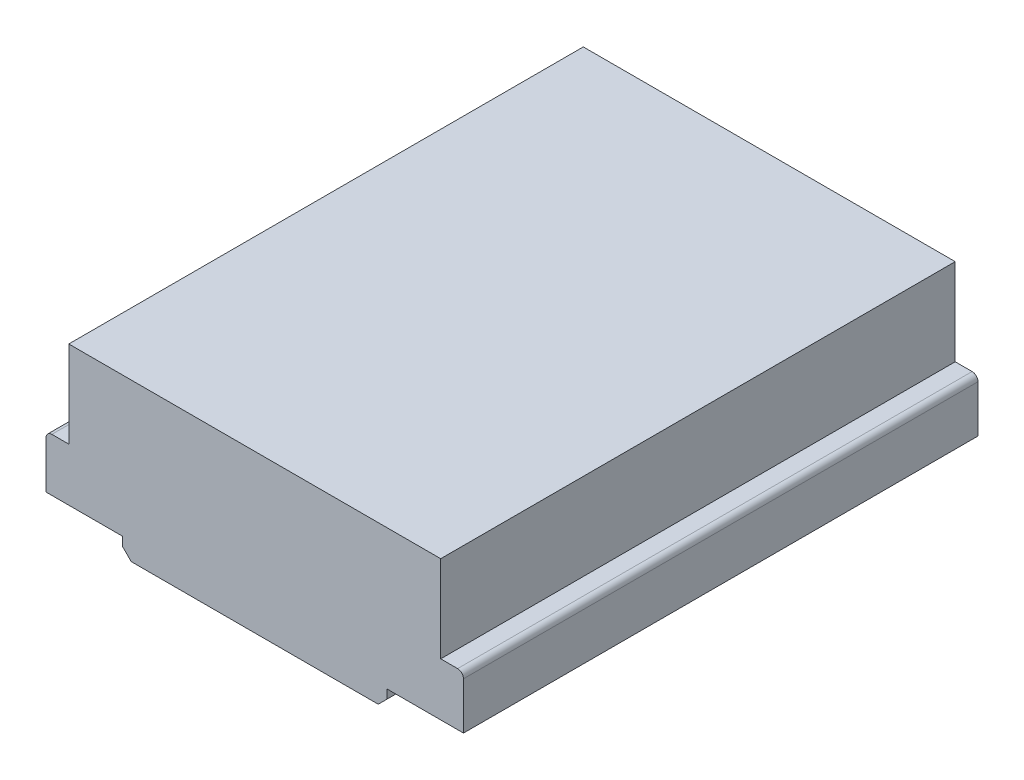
ISO-10303-21;
HEADER;
FILE_DESCRIPTION(('STEP AP214'),'2;1');
FILE_NAME('part.step','',(''),(''),'','','');
FILE_SCHEMA(('AUTOMOTIVE_DESIGN { 1 0 10303 214 1 1 1 1 }'));
ENDSEC;
DATA;
#1=APPLICATION_CONTEXT('core data for automotive mechanical design processes');
#2=APPLICATION_PROTOCOL_DEFINITION('international standard','automotive_design',2000,#1);
#3=PRODUCT_CONTEXT('',#1,'mechanical');
#4=PRODUCT('Part','Part','',(#3));
#5=PRODUCT_RELATED_PRODUCT_CATEGORY('part','',(#4));
#6=PRODUCT_DEFINITION_FORMATION('','',#4);
#7=PRODUCT_DEFINITION_CONTEXT('part definition',#1,'design');
#8=PRODUCT_DEFINITION('design','',#6,#7);
#9=PRODUCT_DEFINITION_SHAPE('','',#8);
#10=(LENGTH_UNIT() NAMED_UNIT(*) SI_UNIT(.MILLI.,.METRE.));
#11=(NAMED_UNIT(*) PLANE_ANGLE_UNIT() SI_UNIT($,.RADIAN.));
#12=(NAMED_UNIT(*) SI_UNIT($,.STERADIAN.) SOLID_ANGLE_UNIT());
#13=UNCERTAINTY_MEASURE_WITH_UNIT(LENGTH_MEASURE(1.E-05),#10,'distance_accuracy_value','');
#14=(GEOMETRIC_REPRESENTATION_CONTEXT(3) GLOBAL_UNCERTAINTY_ASSIGNED_CONTEXT((#13)) GLOBAL_UNIT_ASSIGNED_CONTEXT((#10,
#11,#12)) REPRESENTATION_CONTEXT('',''));
#15=CARTESIAN_POINT('',(0.,0.,0.));
#16=DIRECTION('',(0.,0.,1.));
#17=DIRECTION('',(1.,0.,0.));
#18=AXIS2_PLACEMENT_3D('',#15,#16,#17);
#19=CARTESIAN_POINT('',(2.957133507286E-05,0.983808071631,8.75));
#20=DIRECTION('',(0.,0.,1.));
#21=DIRECTION('',(1.,0.,0.));
#22=AXIS2_PLACEMENT_3D('',#19,#20,#21);
#23=PLANE('',#22);
#24=DIRECTION('',(-0.707106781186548,-0.707106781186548,0.));
#25=VECTOR('',#24,1.);
#26=CARTESIAN_POINT('',(3.884492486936,-1.969580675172,8.75));
#27=LINE('',#26,#25);
#28=CARTESIAN_POINT('',(4.500029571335,-1.354043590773,8.75));
#29=VERTEX_POINT('',#28);
#30=CARTESIAN_POINT('',(4.200029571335,-1.654043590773,8.75));
#31=VERTEX_POINT('',#30);
#32=EDGE_CURVE('E278',#29,#31,#27,.T.);
#33=ORIENTED_EDGE('',*,*,#32,.F.);
#34=DIRECTION('',(0.,1.,0.));
#35=VECTOR('',#34,1.);
#36=CARTESIAN_POINT('',(4.500029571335,-1.654043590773,8.75));
#37=LINE('',#36,#35);
#38=CARTESIAN_POINT('',(4.500029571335,-1.054043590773,8.75));
#39=VERTEX_POINT('',#38);
#40=EDGE_CURVE('E47',#29,#39,#37,.T.);
#41=ORIENTED_EDGE('',*,*,#40,.T.);
#42=DIRECTION('',(1.,0.,0.));
#43=VECTOR('',#42,1.);
#44=CARTESIAN_POINT('',(4.500029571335,-1.054043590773,8.75));
#45=LINE('',#44,#43);
#46=CARTESIAN_POINT('',(7.100029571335,-1.054043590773,8.75));
#47=VERTEX_POINT('',#46);
#48=EDGE_CURVE('E359',#39,#47,#45,.T.);
#49=ORIENTED_EDGE('',*,*,#48,.T.);
#50=DIRECTION('',(0.,1.,0.));
#51=VECTOR('',#50,1.);
#52=CARTESIAN_POINT('',(7.100029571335,-1.054043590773,8.75));
#53=LINE('',#52,#51);
#54=CARTESIAN_POINT('',(7.100029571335,0.545956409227,8.75));
#55=VERTEX_POINT('',#54);
#56=EDGE_CURVE('E360',#47,#55,#53,.T.);
#57=ORIENTED_EDGE('',*,*,#56,.T.);
#58=CARTESIAN_POINT('',(6.900029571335,0.545956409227,8.75));
#59=DIRECTION('',(0.,0.,-1.));
#60=DIRECTION('',(0.707106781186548,0.707106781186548,0.));
#61=AXIS2_PLACEMENT_3D('',#58,#59,#60);
#62=CIRCLE('',#61,0.2);
#63=CARTESIAN_POINT('',(6.900029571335,0.745956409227,8.75));
#64=VERTEX_POINT('',#63);
#65=EDGE_CURVE('E284',#64,#55,#62,.T.);
#66=ORIENTED_EDGE('',*,*,#65,.F.);
#67=DIRECTION('',(-1.,0.,0.));
#68=VECTOR('',#67,1.);
#69=CARTESIAN_POINT('',(7.100029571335,0.745956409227,8.75));
#70=LINE('',#69,#68);
#71=CARTESIAN_POINT('',(6.325029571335,0.745956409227,8.75));
#72=VERTEX_POINT('',#71);
#73=EDGE_CURVE('E372',#64,#72,#70,.T.);
#74=ORIENTED_EDGE('',*,*,#73,.T.);
#75=DIRECTION('',(0.,1.,0.));
#76=VECTOR('',#75,1.);
#77=CARTESIAN_POINT('',(6.325029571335,0.745956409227,8.75));
#78=LINE('',#77,#76);
#79=CARTESIAN_POINT('',(6.325029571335,3.695956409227,8.75));
#80=VERTEX_POINT('',#79);
#81=EDGE_CURVE('E436',#72,#80,#78,.T.);
#82=ORIENTED_EDGE('',*,*,#81,.T.);
#83=DIRECTION('',(-1.,0.,0.));
#84=VECTOR('',#83,1.);
#85=CARTESIAN_POINT('',(6.325029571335,3.695956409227,8.75));
#86=LINE('',#85,#84);
#87=CARTESIAN_POINT('',(-6.324970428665,3.695956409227,8.75));
#88=VERTEX_POINT('',#87);
#89=EDGE_CURVE('E429',#80,#88,#86,.T.);
#90=ORIENTED_EDGE('',*,*,#89,.T.);
#91=DIRECTION('',(0.,-1.,0.));
#92=VECTOR('',#91,1.);
#93=CARTESIAN_POINT('',(-6.324970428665,3.695956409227,8.75));
#94=LINE('',#93,#92);
#95=CARTESIAN_POINT('',(-6.324970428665,0.745956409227,8.75));
#96=VERTEX_POINT('',#95);
#97=EDGE_CURVE('E347',#88,#96,#94,.T.);
#98=ORIENTED_EDGE('',*,*,#97,.T.);
#99=DIRECTION('',(-1.,0.,0.));
#100=VECTOR('',#99,1.);
#101=CARTESIAN_POINT('',(-6.324970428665,0.745956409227,8.75));
#102=LINE('',#101,#100);
#103=CARTESIAN_POINT('',(-6.899970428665,0.745956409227,8.75));
#104=VERTEX_POINT('',#103);
#105=EDGE_CURVE('E11',#96,#104,#102,.T.);
#106=ORIENTED_EDGE('',*,*,#105,.T.);
#107=CARTESIAN_POINT('',(-6.899970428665,0.545956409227,8.75));
#108=DIRECTION('',(0.,0.,-1.));
#109=DIRECTION('',(-0.707106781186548,0.707106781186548,0.));
#110=AXIS2_PLACEMENT_3D('',#107,#108,#109);
#111=CIRCLE('',#110,0.2);
#112=CARTESIAN_POINT('',(-7.099970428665,0.545956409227,8.75));
#113=VERTEX_POINT('',#112);
#114=EDGE_CURVE('E365',#113,#104,#111,.T.);
#115=ORIENTED_EDGE('',*,*,#114,.F.);
#116=DIRECTION('',(0.,-1.,0.));
#117=VECTOR('',#116,1.);
#118=CARTESIAN_POINT('',(-7.099970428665,0.745956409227,8.75));
#119=LINE('',#118,#117);
#120=CARTESIAN_POINT('',(-7.099970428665,-1.054043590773,8.75));
#121=VERTEX_POINT('',#120);
#122=EDGE_CURVE('E348',#113,#121,#119,.T.);
#123=ORIENTED_EDGE('',*,*,#122,.T.);
#124=DIRECTION('',(1.,0.,0.));
#125=VECTOR('',#124,1.);
#126=CARTESIAN_POINT('',(-7.099970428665,-1.054043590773,8.75));
#127=LINE('',#126,#125);
#128=CARTESIAN_POINT('',(-4.499970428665,-1.054043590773,8.75));
#129=VERTEX_POINT('',#128);
#130=EDGE_CURVE('E444',#121,#129,#127,.T.);
#131=ORIENTED_EDGE('',*,*,#130,.T.);
#132=DIRECTION('',(0.,-1.,0.));
#133=VECTOR('',#132,1.);
#134=CARTESIAN_POINT('',(-4.499970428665,-1.054043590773,8.75));
#135=LINE('',#134,#133);
#136=CARTESIAN_POINT('',(-4.499970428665,-1.354043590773,8.75));
#137=VERTEX_POINT('',#136);
#138=EDGE_CURVE('E26',#129,#137,#135,.T.);
#139=ORIENTED_EDGE('',*,*,#138,.T.);
#140=DIRECTION('',(-0.707106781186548,0.707106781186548,0.));
#141=VECTOR('',#140,1.);
#142=CARTESIAN_POINT('',(-3.884433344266,-1.969580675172,8.75));
#143=LINE('',#142,#141);
#144=CARTESIAN_POINT('',(-4.199970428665,-1.654043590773,8.75));
#145=VERTEX_POINT('',#144);
#146=EDGE_CURVE('E325',#145,#137,#143,.T.);
#147=ORIENTED_EDGE('',*,*,#146,.F.);
#148=DIRECTION('',(1.,0.,0.));
#149=VECTOR('',#148,1.);
#150=CARTESIAN_POINT('',(-4.499970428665,-1.654043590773,8.75));
#151=LINE('',#150,#149);
#152=EDGE_CURVE('E318',#145,#31,#151,.T.);
#153=ORIENTED_EDGE('',*,*,#152,.T.);
#154=EDGE_LOOP('',(#33,#41,#49,#57,#66,#74,#82,#90,#98,#106,#115,#123,#131,#139,#147,#153));
#155=FACE_BOUND('',#154,.T.);
#156=ADVANCED_FACE('F17',(#155),#23,.T.);
#157=CARTESIAN_POINT('',(-6.324970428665,0.745956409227,0.));
#158=DIRECTION('',(0.,1.,0.));
#159=DIRECTION('',(1.,0.,0.));
#160=AXIS2_PLACEMENT_3D('',#157,#158,#159);
#161=PLANE('',#160);
#162=DIRECTION('',(0.,0.,-1.));
#163=VECTOR('',#162,1.);
#164=CARTESIAN_POINT('',(-6.899970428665,0.745956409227,0.));
#165=LINE('',#164,#163);
#166=CARTESIAN_POINT('',(-6.899970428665,0.745956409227,-8.75));
#167=VERTEX_POINT('',#166);
#168=EDGE_CURVE('E361',#104,#167,#165,.T.);
#169=ORIENTED_EDGE('',*,*,#168,.F.);
#170=ORIENTED_EDGE('',*,*,#105,.F.);
#171=DIRECTION('',(0.,0.,-1.));
#172=VECTOR('',#171,1.);
#173=CARTESIAN_POINT('',(-6.324970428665,0.745956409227,0.));
#174=LINE('',#173,#172);
#175=CARTESIAN_POINT('',(-6.324970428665,0.745956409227,-8.75));
#176=VERTEX_POINT('',#175);
#177=EDGE_CURVE('E344',#96,#176,#174,.T.);
#178=ORIENTED_EDGE('',*,*,#177,.T.);
#179=DIRECTION('',(1.,0.,0.));
#180=VECTOR('',#179,1.);
#181=CARTESIAN_POINT('',(-6.324970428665,0.745956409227,-8.75));
#182=LINE('',#181,#180);
#183=EDGE_CURVE('E384',#167,#176,#182,.T.);
#184=ORIENTED_EDGE('',*,*,#183,.F.);
#185=EDGE_LOOP('',(#169,#170,#178,#184));
#186=FACE_BOUND('',#185,.T.);
#187=ADVANCED_FACE('F19',(#186),#161,.T.);
#188=CARTESIAN_POINT('',(-4.499970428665,-1.054043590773,0.));
#189=DIRECTION('',(-1.,0.,0.));
#190=DIRECTION('',(0.,0.,1.));
#191=AXIS2_PLACEMENT_3D('',#188,#189,#190);
#192=PLANE('',#191);
#193=DIRECTION('',(0.,0.,-1.));
#194=VECTOR('',#193,1.);
#195=CARTESIAN_POINT('',(-4.499970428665,-1.354043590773,0.));
#196=LINE('',#195,#194);
#197=CARTESIAN_POINT('',(-4.499970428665,-1.354043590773,7.749997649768));
#198=VERTEX_POINT('',#197);
#199=EDGE_CURVE('E329',#137,#198,#196,.T.);
#200=ORIENTED_EDGE('',*,*,#199,.F.);
#201=ORIENTED_EDGE('',*,*,#138,.F.);
#202=DIRECTION('',(0.,0.,1.));
#203=VECTOR('',#202,1.);
#204=CARTESIAN_POINT('',(-4.499970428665,-1.054043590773,0.));
#205=LINE('',#204,#203);
#206=CARTESIAN_POINT('',(-4.499970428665,-1.054043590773,7.749997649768));
#207=VERTEX_POINT('',#206);
#208=EDGE_CURVE('E409',#207,#129,#205,.T.);
#209=ORIENTED_EDGE('',*,*,#208,.F.);
#210=DIRECTION('',(0.,-1.,0.));
#211=VECTOR('',#210,1.);
#212=CARTESIAN_POINT('',(-4.499970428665,-1.054043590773,7.749997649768));
#213=LINE('',#212,#211);
#214=EDGE_CURVE('E306',#207,#198,#213,.T.);
#215=ORIENTED_EDGE('',*,*,#214,.T.);
#216=EDGE_LOOP('',(#200,#201,#209,#215));
#217=FACE_BOUND('',#216,.T.);
#218=ADVANCED_FACE('F732',(#217),#192,.T.);
#219=CARTESIAN_POINT('',(4.500029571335,-1.654043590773,0.));
#220=DIRECTION('',(1.,0.,0.));
#221=DIRECTION('',(0.,1.,0.));
#222=AXIS2_PLACEMENT_3D('',#219,#220,#221);
#223=PLANE('',#222);
#224=DIRECTION('',(0.,0.,1.));
#225=VECTOR('',#224,1.);
#226=CARTESIAN_POINT('',(4.500029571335,-1.354043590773,0.));
#227=LINE('',#226,#225);
#228=CARTESIAN_POINT('',(4.500029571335,-1.354043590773,7.749997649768));
#229=VERTEX_POINT('',#228);
#230=EDGE_CURVE('E295',#229,#29,#227,.T.);
#231=ORIENTED_EDGE('',*,*,#230,.F.);
#232=DIRECTION('',(0.,1.,0.));
#233=VECTOR('',#232,1.);
#234=CARTESIAN_POINT('',(4.500029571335,-1.354043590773,7.749997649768));
#235=LINE('',#234,#233);
#236=CARTESIAN_POINT('',(4.500029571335,-1.054043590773,7.749997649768));
#237=VERTEX_POINT('',#236);
#238=EDGE_CURVE('E314',#229,#237,#235,.T.);
#239=ORIENTED_EDGE('',*,*,#238,.T.);
#240=DIRECTION('',(0.,0.,1.));
#241=VECTOR('',#240,1.);
#242=CARTESIAN_POINT('',(4.500029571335,-1.054043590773,0.));
#243=LINE('',#242,#241);
#244=EDGE_CURVE('E406',#237,#39,#243,.T.);
#245=ORIENTED_EDGE('',*,*,#244,.T.);
#246=ORIENTED_EDGE('',*,*,#40,.F.);
#247=EDGE_LOOP('',(#231,#239,#245,#246));
#248=FACE_BOUND('',#247,.T.);
#249=ADVANCED_FACE('F761',(#248),#223,.T.);
#250=CARTESIAN_POINT('',(4.500029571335,-1.054043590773,0.));
#251=DIRECTION('',(0.,-1.,0.));
#252=DIRECTION('',(-1.,0.,0.));
#253=AXIS2_PLACEMENT_3D('',#250,#251,#252);
#254=PLANE('',#253);
#255=DIRECTION('',(0.,0.,1.));
#256=VECTOR('',#255,1.);
#257=CARTESIAN_POINT('',(7.100029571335,-1.054043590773,0.));
#258=LINE('',#257,#256);
#259=CARTESIAN_POINT('',(7.100029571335,-1.054043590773,-8.75));
#260=VERTEX_POINT('',#259);
#261=EDGE_CURVE('E355',#260,#47,#258,.T.);
#262=ORIENTED_EDGE('',*,*,#261,.T.);
#263=ORIENTED_EDGE('',*,*,#48,.F.);
#264=ORIENTED_EDGE('',*,*,#244,.F.);
#265=DIRECTION('',(1.,0.,0.));
#266=VECTOR('',#265,1.);
#267=CARTESIAN_POINT('',(-4.499970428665,-1.054043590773,7.749997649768));
#268=LINE('',#267,#266);
#269=EDGE_CURVE('E310',#207,#237,#268,.T.);
#270=ORIENTED_EDGE('',*,*,#269,.F.);
#271=ORIENTED_EDGE('',*,*,#208,.T.);
#272=ORIENTED_EDGE('',*,*,#130,.F.);
#273=DIRECTION('',(0.,0.,1.));
#274=VECTOR('',#273,1.);
#275=CARTESIAN_POINT('',(-7.099970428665,-1.054043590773,0.));
#276=LINE('',#275,#274);
#277=CARTESIAN_POINT('',(-7.099970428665,-1.054043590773,-8.75));
#278=VERTEX_POINT('',#277);
#279=EDGE_CURVE('E422',#278,#121,#276,.T.);
#280=ORIENTED_EDGE('',*,*,#279,.F.);
#281=DIRECTION('',(-1.,0.,0.));
#282=VECTOR('',#281,1.);
#283=CARTESIAN_POINT('',(-7.099970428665,-1.054043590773,-8.75));
#284=LINE('',#283,#282);
#285=CARTESIAN_POINT('',(-4.499970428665,-1.054043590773,-8.75));
#286=VERTEX_POINT('',#285);
#287=EDGE_CURVE('E376',#286,#278,#284,.T.);
#288=ORIENTED_EDGE('',*,*,#287,.F.);
#289=DIRECTION('',(0.,0.,1.));
#290=VECTOR('',#289,1.);
#291=CARTESIAN_POINT('',(-4.499970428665,-1.054043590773,0.));
#292=LINE('',#291,#290);
#293=CARTESIAN_POINT('',(-4.499970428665,-1.054043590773,-7.750002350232));
#294=VERTEX_POINT('',#293);
#295=EDGE_CURVE('E285',#286,#294,#292,.T.);
#296=ORIENTED_EDGE('',*,*,#295,.T.);
#297=DIRECTION('',(1.,0.,0.));
#298=VECTOR('',#297,1.);
#299=CARTESIAN_POINT('',(-4.499970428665,-1.054043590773,-7.750002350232));
#300=LINE('',#299,#298);
#301=CARTESIAN_POINT('',(4.500029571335,-1.054043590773,-7.750002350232));
#302=VERTEX_POINT('',#301);
#303=EDGE_CURVE('E257',#294,#302,#300,.T.);
#304=ORIENTED_EDGE('',*,*,#303,.T.);
#305=DIRECTION('',(0.,0.,1.));
#306=VECTOR('',#305,1.);
#307=CARTESIAN_POINT('',(4.500029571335,-1.054043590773,0.));
#308=LINE('',#307,#306);
#309=CARTESIAN_POINT('',(4.500029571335,-1.054043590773,-8.75));
#310=VERTEX_POINT('',#309);
#311=EDGE_CURVE('E335',#310,#302,#308,.T.);
#312=ORIENTED_EDGE('',*,*,#311,.F.);
#313=DIRECTION('',(-1.,0.,0.));
#314=VECTOR('',#313,1.);
#315=CARTESIAN_POINT('',(4.500029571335,-1.054043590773,-8.75));
#316=LINE('',#315,#314);
#317=EDGE_CURVE('E413',#260,#310,#316,.T.);
#318=ORIENTED_EDGE('',*,*,#317,.F.);
#319=EDGE_LOOP('',(#262,#263,#264,#270,#271,#272,#280,#288,#296,#304,#312,#318));
#320=FACE_BOUND('',#319,.T.);
#321=ADVANCED_FACE('F669',(#320),#254,.T.);
#322=CARTESIAN_POINT('',(7.100029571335,-1.054043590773,0.));
#323=DIRECTION('',(1.,0.,0.));
#324=DIRECTION('',(0.,1.,0.));
#325=AXIS2_PLACEMENT_3D('',#322,#323,#324);
#326=PLANE('',#325);
#327=DIRECTION('',(0.,0.,-1.));
#328=VECTOR('',#327,1.);
#329=CARTESIAN_POINT('',(7.100029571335,0.545956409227,0.));
#330=LINE('',#329,#328);
#331=CARTESIAN_POINT('',(7.100029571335,0.545956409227,-8.75));
#332=VERTEX_POINT('',#331);
#333=EDGE_CURVE('E343',#55,#332,#330,.T.);
#334=ORIENTED_EDGE('',*,*,#333,.F.);
#335=ORIENTED_EDGE('',*,*,#56,.F.);
#336=ORIENTED_EDGE('',*,*,#261,.F.);
#337=DIRECTION('',(0.,-1.,0.));
#338=VECTOR('',#337,1.);
#339=CARTESIAN_POINT('',(7.100029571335,-1.054043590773,-8.75));
#340=LINE('',#339,#338);
#341=EDGE_CURVE('E405',#332,#260,#340,.T.);
#342=ORIENTED_EDGE('',*,*,#341,.F.);
#343=EDGE_LOOP('',(#334,#335,#336,#342));
#344=FACE_BOUND('',#343,.T.);
#345=ADVANCED_FACE('F703',(#344),#326,.T.);
#346=CARTESIAN_POINT('',(6.325029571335,0.745956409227,0.));
#347=DIRECTION('',(1.,0.,0.));
#348=DIRECTION('',(0.,1.,0.));
#349=AXIS2_PLACEMENT_3D('',#346,#347,#348);
#350=PLANE('',#349);
#351=DIRECTION('',(0.,0.,1.));
#352=VECTOR('',#351,1.);
#353=CARTESIAN_POINT('',(6.325029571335,3.695956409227,0.));
#354=LINE('',#353,#352);
#355=CARTESIAN_POINT('',(6.325029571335,3.695956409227,-8.75));
#356=VERTEX_POINT('',#355);
#357=EDGE_CURVE('E432',#356,#80,#354,.T.);
#358=ORIENTED_EDGE('',*,*,#357,.T.);
#359=ORIENTED_EDGE('',*,*,#81,.F.);
#360=DIRECTION('',(0.,0.,1.));
#361=VECTOR('',#360,1.);
#362=CARTESIAN_POINT('',(6.325029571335,0.745956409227,0.));
#363=LINE('',#362,#361);
#364=CARTESIAN_POINT('',(6.325029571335,0.745956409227,-8.75));
#365=VERTEX_POINT('',#364);
#366=EDGE_CURVE('E368',#365,#72,#363,.T.);
#367=ORIENTED_EDGE('',*,*,#366,.F.);
#368=DIRECTION('',(0.,-1.,0.));
#369=VECTOR('',#368,1.);
#370=CARTESIAN_POINT('',(6.325029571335,0.745956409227,-8.75));
#371=LINE('',#370,#369);
#372=EDGE_CURVE('E402',#356,#365,#371,.T.);
#373=ORIENTED_EDGE('',*,*,#372,.F.);
#374=EDGE_LOOP('',(#358,#359,#367,#373));
#375=FACE_BOUND('',#374,.T.);
#376=ADVANCED_FACE('F693',(#375),#350,.T.);
#377=CARTESIAN_POINT('',(6.325029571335,3.695956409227,0.));
#378=DIRECTION('',(0.,1.,0.));
#379=DIRECTION('',(1.,0.,0.));
#380=AXIS2_PLACEMENT_3D('',#377,#378,#379);
#381=PLANE('',#380);
#382=DIRECTION('',(0.,0.,1.));
#383=VECTOR('',#382,1.);
#384=CARTESIAN_POINT('',(-6.324970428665,3.695956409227,0.));
#385=LINE('',#384,#383);
#386=CARTESIAN_POINT('',(-6.324970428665,3.695956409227,-8.75));
#387=VERTEX_POINT('',#386);
#388=EDGE_CURVE('E398',#387,#88,#385,.T.);
#389=ORIENTED_EDGE('',*,*,#388,.T.);
#390=ORIENTED_EDGE('',*,*,#89,.F.);
#391=ORIENTED_EDGE('',*,*,#357,.F.);
#392=DIRECTION('',(1.,0.,0.));
#393=VECTOR('',#392,1.);
#394=CARTESIAN_POINT('',(6.325029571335,3.695956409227,-8.75));
#395=LINE('',#394,#393);
#396=EDGE_CURVE('E392',#387,#356,#395,.T.);
#397=ORIENTED_EDGE('',*,*,#396,.F.);
#398=EDGE_LOOP('',(#389,#390,#391,#397));
#399=FACE_BOUND('',#398,.T.);
#400=ADVANCED_FACE('F686',(#399),#381,.T.);
#401=CARTESIAN_POINT('',(-6.324970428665,3.695956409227,0.));
#402=DIRECTION('',(-1.,0.,0.));
#403=DIRECTION('',(0.,0.,1.));
#404=AXIS2_PLACEMENT_3D('',#401,#402,#403);
#405=PLANE('',#404);
#406=ORIENTED_EDGE('',*,*,#177,.F.);
#407=ORIENTED_EDGE('',*,*,#97,.F.);
#408=ORIENTED_EDGE('',*,*,#388,.F.);
#409=DIRECTION('',(0.,1.,0.));
#410=VECTOR('',#409,1.);
#411=CARTESIAN_POINT('',(-6.324970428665,3.695956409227,-8.75));
#412=LINE('',#411,#410);
#413=EDGE_CURVE('E388',#176,#387,#412,.T.);
#414=ORIENTED_EDGE('',*,*,#413,.F.);
#415=EDGE_LOOP('',(#406,#407,#408,#414));
#416=FACE_BOUND('',#415,.T.);
#417=ADVANCED_FACE('F682',(#416),#405,.T.);
#418=CARTESIAN_POINT('',(-7.099970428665,0.745956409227,0.));
#419=DIRECTION('',(-1.,0.,0.));
#420=DIRECTION('',(0.,0.,1.));
#421=AXIS2_PLACEMENT_3D('',#418,#419,#420);
#422=PLANE('',#421);
#423=DIRECTION('',(0.,0.,1.));
#424=VECTOR('',#423,1.);
#425=CARTESIAN_POINT('',(-7.099970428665,0.545956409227,0.));
#426=LINE('',#425,#424);
#427=CARTESIAN_POINT('',(-7.099970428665,0.545956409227,-8.75));
#428=VERTEX_POINT('',#427);
#429=EDGE_CURVE('E364',#428,#113,#426,.T.);
#430=ORIENTED_EDGE('',*,*,#429,.F.);
#431=DIRECTION('',(0.,1.,0.));
#432=VECTOR('',#431,1.);
#433=CARTESIAN_POINT('',(-7.099970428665,0.745956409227,-8.75));
#434=LINE('',#433,#432);
#435=EDGE_CURVE('E253',#278,#428,#434,.T.);
#436=ORIENTED_EDGE('',*,*,#435,.F.);
#437=ORIENTED_EDGE('',*,*,#279,.T.);
#438=ORIENTED_EDGE('',*,*,#122,.F.);
#439=EDGE_LOOP('',(#430,#436,#437,#438));
#440=FACE_BOUND('',#439,.T.);
#441=ADVANCED_FACE('F671',(#440),#422,.T.);
#442=CARTESIAN_POINT('',(-6.899970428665,0.545956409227,0.));
#443=DIRECTION('',(0.,0.,1.));
#444=DIRECTION('',(-0.707106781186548,0.707106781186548,0.));
#445=AXIS2_PLACEMENT_3D('',#442,#443,#444);
#446=CYLINDRICAL_SURFACE('',#445,0.2);
#447=ORIENTED_EDGE('',*,*,#114,.T.);
#448=ORIENTED_EDGE('',*,*,#168,.T.);
#449=CARTESIAN_POINT('',(-6.899970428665,0.545956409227,-8.75));
#450=DIRECTION('',(0.,0.,1.));
#451=DIRECTION('',(-0.707106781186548,0.707106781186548,0.));
#452=AXIS2_PLACEMENT_3D('',#449,#450,#451);
#453=CIRCLE('',#452,0.2);
#454=EDGE_CURVE('E380',#167,#428,#453,.T.);
#455=ORIENTED_EDGE('',*,*,#454,.T.);
#456=ORIENTED_EDGE('',*,*,#429,.T.);
#457=EDGE_LOOP('',(#447,#448,#455,#456));
#458=FACE_BOUND('',#457,.T.);
#459=ADVANCED_FACE('F674',(#458),#446,.T.);
#460=CARTESIAN_POINT('',(2.957133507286E-05,0.983808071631,-8.75));
#461=DIRECTION('',(0.,0.,-1.));
#462=DIRECTION('',(0.,-1.,0.));
#463=AXIS2_PLACEMENT_3D('',#460,#461,#462);
#464=PLANE('',#463);
#465=DIRECTION('',(0.707106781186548,-0.707106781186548,0.));
#466=VECTOR('',#465,1.);
#467=CARTESIAN_POINT('',(-3.884433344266,-1.969580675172,-8.75));
#468=LINE('',#467,#466);
#469=CARTESIAN_POINT('',(-4.499970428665,-1.354043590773,-8.75));
#470=VERTEX_POINT('',#469);
#471=CARTESIAN_POINT('',(-4.199970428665,-1.654043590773,-8.75));
#472=VERTEX_POINT('',#471);
#473=EDGE_CURVE('E220',#470,#472,#468,.T.);
#474=ORIENTED_EDGE('',*,*,#473,.F.);
#475=DIRECTION('',(0.,1.,0.));
#476=VECTOR('',#475,1.);
#477=CARTESIAN_POINT('',(-4.499970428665,-1.054043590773,-8.75));
#478=LINE('',#477,#476);
#479=EDGE_CURVE('E282',#470,#286,#478,.T.);
#480=ORIENTED_EDGE('',*,*,#479,.T.);
#481=ORIENTED_EDGE('',*,*,#287,.T.);
#482=ORIENTED_EDGE('',*,*,#435,.T.);
#483=ORIENTED_EDGE('',*,*,#454,.F.);
#484=ORIENTED_EDGE('',*,*,#183,.T.);
#485=ORIENTED_EDGE('',*,*,#413,.T.);
#486=ORIENTED_EDGE('',*,*,#396,.T.);
#487=ORIENTED_EDGE('',*,*,#372,.T.);
#488=DIRECTION('',(1.,0.,0.));
#489=VECTOR('',#488,1.);
#490=CARTESIAN_POINT('',(7.100029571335,0.745956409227,-8.75));
#491=LINE('',#490,#489);
#492=CARTESIAN_POINT('',(6.900029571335,0.745956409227,-8.75));
#493=VERTEX_POINT('',#492);
#494=EDGE_CURVE('E266',#365,#493,#491,.T.);
#495=ORIENTED_EDGE('',*,*,#494,.T.);
#496=CARTESIAN_POINT('',(6.900029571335,0.545956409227,-8.75));
#497=DIRECTION('',(0.,0.,1.));
#498=DIRECTION('',(0.707106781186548,0.707106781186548,0.));
#499=AXIS2_PLACEMENT_3D('',#496,#497,#498);
#500=CIRCLE('',#499,0.2);
#501=EDGE_CURVE('E267',#332,#493,#500,.T.);
#502=ORIENTED_EDGE('',*,*,#501,.F.);
#503=ORIENTED_EDGE('',*,*,#341,.T.);
#504=ORIENTED_EDGE('',*,*,#317,.T.);
#505=DIRECTION('',(0.,-1.,0.));
#506=VECTOR('',#505,1.);
#507=CARTESIAN_POINT('',(4.500029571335,-1.654043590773,-8.75));
#508=LINE('',#507,#506);
#509=CARTESIAN_POINT('',(4.500029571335,-1.354043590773,-8.75));
#510=VERTEX_POINT('',#509);
#511=EDGE_CURVE('E332',#310,#510,#508,.T.);
#512=ORIENTED_EDGE('',*,*,#511,.T.);
#513=DIRECTION('',(0.707106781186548,0.707106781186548,0.));
#514=VECTOR('',#513,1.);
#515=CARTESIAN_POINT('',(3.884492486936,-1.969580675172,-8.75));
#516=LINE('',#515,#514);
#517=CARTESIAN_POINT('',(4.200029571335,-1.654043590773,-8.75));
#518=VERTEX_POINT('',#517);
#519=EDGE_CURVE('E223',#518,#510,#516,.T.);
#520=ORIENTED_EDGE('',*,*,#519,.F.);
#521=DIRECTION('',(-1.,0.,0.));
#522=VECTOR('',#521,1.);
#523=CARTESIAN_POINT('',(-4.499970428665,-1.654043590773,-8.75));
#524=LINE('',#523,#522);
#525=EDGE_CURVE('E215',#518,#472,#524,.T.);
#526=ORIENTED_EDGE('',*,*,#525,.T.);
#527=EDGE_LOOP('',(#474,#480,#481,#482,#483,#484,#485,#486,#487,#495,#502,#503,#504,#512,#520,#526));
#528=FACE_BOUND('',#527,.T.);
#529=ADVANCED_FACE('F217',(#528),#464,.T.);
#530=CARTESIAN_POINT('',(7.100029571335,0.745956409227,0.));
#531=DIRECTION('',(0.,1.,0.));
#532=DIRECTION('',(1.,0.,0.));
#533=AXIS2_PLACEMENT_3D('',#530,#531,#532);
#534=PLANE('',#533);
#535=DIRECTION('',(0.,0.,1.));
#536=VECTOR('',#535,1.);
#537=CARTESIAN_POINT('',(6.900029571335,0.745956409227,0.));
#538=LINE('',#537,#536);
#539=EDGE_CURVE('E262',#493,#64,#538,.T.);
#540=ORIENTED_EDGE('',*,*,#539,.F.);
#541=ORIENTED_EDGE('',*,*,#494,.F.);
#542=ORIENTED_EDGE('',*,*,#366,.T.);
#543=ORIENTED_EDGE('',*,*,#73,.F.);
#544=EDGE_LOOP('',(#540,#541,#542,#543));
#545=FACE_BOUND('',#544,.T.);
#546=ADVANCED_FACE('F695',(#545),#534,.T.);
#547=CARTESIAN_POINT('',(6.900029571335,0.545956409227,0.));
#548=DIRECTION('',(0.,0.,1.));
#549=DIRECTION('',(0.707106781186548,0.707106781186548,0.));
#550=AXIS2_PLACEMENT_3D('',#547,#548,#549);
#551=CYLINDRICAL_SURFACE('',#550,0.2);
#552=ORIENTED_EDGE('',*,*,#65,.T.);
#553=ORIENTED_EDGE('',*,*,#333,.T.);
#554=ORIENTED_EDGE('',*,*,#501,.T.);
#555=ORIENTED_EDGE('',*,*,#539,.T.);
#556=EDGE_LOOP('',(#552,#553,#554,#555));
#557=FACE_BOUND('',#556,.T.);
#558=ADVANCED_FACE('F698',(#557),#551,.T.);
#559=CARTESIAN_POINT('',(-4.499970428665,-1.054043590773,0.));
#560=DIRECTION('',(-1.,0.,0.));
#561=DIRECTION('',(0.,0.,1.));
#562=AXIS2_PLACEMENT_3D('',#559,#560,#561);
#563=PLANE('',#562);
#564=DIRECTION('',(0.,0.,-1.));
#565=VECTOR('',#564,1.);
#566=CARTESIAN_POINT('',(-4.499970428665,-1.354043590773,0.));
#567=LINE('',#566,#565);
#568=CARTESIAN_POINT('',(-4.499970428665,-1.354043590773,-7.750002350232));
#569=VERTEX_POINT('',#568);
#570=EDGE_CURVE('E242',#569,#470,#567,.T.);
#571=ORIENTED_EDGE('',*,*,#570,.F.);
#572=DIRECTION('',(0.,1.,0.));
#573=VECTOR('',#572,1.);
#574=CARTESIAN_POINT('',(-4.499970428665,-1.354043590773,-7.750002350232));
#575=LINE('',#574,#573);
#576=EDGE_CURVE('E228',#569,#294,#575,.T.);
#577=ORIENTED_EDGE('',*,*,#576,.T.);
#578=ORIENTED_EDGE('',*,*,#295,.F.);
#579=ORIENTED_EDGE('',*,*,#479,.F.);
#580=EDGE_LOOP('',(#571,#577,#578,#579));
#581=FACE_BOUND('',#580,.T.);
#582=ADVANCED_FACE('F665',(#581),#563,.T.);
#583=CARTESIAN_POINT('',(4.500029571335,-1.654043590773,0.));
#584=DIRECTION('',(1.,0.,0.));
#585=DIRECTION('',(0.,1.,0.));
#586=AXIS2_PLACEMENT_3D('',#583,#584,#585);
#587=PLANE('',#586);
#588=DIRECTION('',(0.,0.,1.));
#589=VECTOR('',#588,1.);
#590=CARTESIAN_POINT('',(4.500029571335,-1.354043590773,0.));
#591=LINE('',#590,#589);
#592=CARTESIAN_POINT('',(4.500029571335,-1.354043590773,-7.750002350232));
#593=VERTEX_POINT('',#592);
#594=EDGE_CURVE('E275',#510,#593,#591,.T.);
#595=ORIENTED_EDGE('',*,*,#594,.F.);
#596=ORIENTED_EDGE('',*,*,#511,.F.);
#597=ORIENTED_EDGE('',*,*,#311,.T.);
#598=DIRECTION('',(0.,-1.,0.));
#599=VECTOR('',#598,1.);
#600=CARTESIAN_POINT('',(4.500029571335,-1.654043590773,-7.750002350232));
#601=LINE('',#600,#599);
#602=EDGE_CURVE('E271',#302,#593,#601,.T.);
#603=ORIENTED_EDGE('',*,*,#602,.T.);
#604=EDGE_LOOP('',(#595,#596,#597,#603));
#605=FACE_BOUND('',#604,.T.);
#606=ADVANCED_FACE('F709',(#605),#587,.T.);
#607=CARTESIAN_POINT('',(-4.349970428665,-1.504043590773,0.));
#608=DIRECTION('',(-0.707106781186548,-0.707106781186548,0.));
#609=DIRECTION('',(-0.707106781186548,0.707106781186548,0.));
#610=AXIS2_PLACEMENT_3D('',#607,#608,#609);
#611=PLANE('',#610);
#612=ORIENTED_EDGE('',*,*,#146,.T.);
#613=ORIENTED_EDGE('',*,*,#199,.T.);
#614=DIRECTION('',(0.707106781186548,-0.707106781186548,0.));
#615=VECTOR('',#614,1.);
#616=CARTESIAN_POINT('',(-4.499970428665,-1.354043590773,7.749997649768));
#617=LINE('',#616,#615);
#618=CARTESIAN_POINT('',(-4.199970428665,-1.654043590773,7.749997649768));
#619=VERTEX_POINT('',#618);
#620=EDGE_CURVE('E302',#198,#619,#617,.T.);
#621=ORIENTED_EDGE('',*,*,#620,.T.);
#622=DIRECTION('',(0.,0.,1.));
#623=VECTOR('',#622,1.);
#624=CARTESIAN_POINT('',(-4.199970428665,-1.654043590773,0.));
#625=LINE('',#624,#623);
#626=EDGE_CURVE('E321',#619,#145,#625,.T.);
#627=ORIENTED_EDGE('',*,*,#626,.T.);
#628=EDGE_LOOP('',(#612,#613,#621,#627));
#629=FACE_BOUND('',#628,.T.);
#630=ADVANCED_FACE('F741',(#629),#611,.T.);
#631=CARTESIAN_POINT('',(-4.499970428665,-1.654043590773,0.));
#632=DIRECTION('',(0.,-1.,0.));
#633=DIRECTION('',(0.,0.,-1.));
#634=AXIS2_PLACEMENT_3D('',#631,#632,#633);
#635=PLANE('',#634);
#636=DIRECTION('',(0.,0.,-1.));
#637=VECTOR('',#636,1.);
#638=CARTESIAN_POINT('',(4.200029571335,-1.654043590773,0.));
#639=LINE('',#638,#637);
#640=CARTESIAN_POINT('',(4.200029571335,-1.654043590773,7.749997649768));
#641=VERTEX_POINT('',#640);
#642=EDGE_CURVE('E290',#31,#641,#639,.T.);
#643=ORIENTED_EDGE('',*,*,#642,.F.);
#644=ORIENTED_EDGE('',*,*,#152,.F.);
#645=ORIENTED_EDGE('',*,*,#626,.F.);
#646=DIRECTION('',(1.,0.,0.));
#647=VECTOR('',#646,1.);
#648=CARTESIAN_POINT('',(-4.499970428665,-1.654043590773,7.749997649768));
#649=LINE('',#648,#647);
#650=EDGE_CURVE('E299',#619,#641,#649,.T.);
#651=ORIENTED_EDGE('',*,*,#650,.T.);
#652=EDGE_LOOP('',(#643,#644,#645,#651));
#653=FACE_BOUND('',#652,.T.);
#654=ADVANCED_FACE('F735',(#653),#635,.T.);
#655=CARTESIAN_POINT('',(-4.499970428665,-1.054043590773,7.749997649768));
#656=DIRECTION('',(0.,0.,1.));
#657=DIRECTION('',(1.,0.,0.));
#658=AXIS2_PLACEMENT_3D('',#655,#656,#657);
#659=PLANE('',#658);
#660=DIRECTION('',(0.707106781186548,0.707106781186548,0.));
#661=VECTOR('',#660,1.);
#662=CARTESIAN_POINT('',(2.250029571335,-3.604043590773,7.749997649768));
#663=LINE('',#662,#661);
#664=EDGE_CURVE('E294',#641,#229,#663,.T.);
#665=ORIENTED_EDGE('',*,*,#664,.F.);
#666=ORIENTED_EDGE('',*,*,#650,.F.);
#667=ORIENTED_EDGE('',*,*,#620,.F.);
#668=ORIENTED_EDGE('',*,*,#214,.F.);
#669=ORIENTED_EDGE('',*,*,#269,.T.);
#670=ORIENTED_EDGE('',*,*,#238,.F.);
#671=EDGE_LOOP('',(#665,#666,#667,#668,#669,#670));
#672=FACE_BOUND('',#671,.T.);
#673=ADVANCED_FACE('F722',(#672),#659,.F.);
#674=CARTESIAN_POINT('',(4.350029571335,-1.504043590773,0.));
#675=DIRECTION('',(0.707106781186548,-0.707106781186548,0.));
#676=DIRECTION('',(0.,0.,-1.));
#677=AXIS2_PLACEMENT_3D('',#674,#675,#676);
#678=PLANE('',#677);
#679=ORIENTED_EDGE('',*,*,#32,.T.);
#680=ORIENTED_EDGE('',*,*,#642,.T.);
#681=ORIENTED_EDGE('',*,*,#664,.T.);
#682=ORIENTED_EDGE('',*,*,#230,.T.);
#683=EDGE_LOOP('',(#679,#680,#681,#682));
#684=FACE_BOUND('',#683,.T.);
#685=ADVANCED_FACE('F713',(#684),#678,.T.);
#686=CARTESIAN_POINT('',(4.350029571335,-1.504043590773,0.));
#687=DIRECTION('',(0.707106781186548,-0.707106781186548,0.));
#688=DIRECTION('',(0.,0.,-1.));
#689=AXIS2_PLACEMENT_3D('',#686,#687,#688);
#690=PLANE('',#689);
#691=DIRECTION('',(-0.707106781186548,-0.707106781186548,0.));
#692=VECTOR('',#691,1.);
#693=CARTESIAN_POINT('',(2.100029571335,-3.754043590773,-7.750002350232));
#694=LINE('',#693,#692);
#695=CARTESIAN_POINT('',(4.200029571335,-1.654043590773,-7.750002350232));
#696=VERTEX_POINT('',#695);
#697=EDGE_CURVE('E261',#593,#696,#694,.T.);
#698=ORIENTED_EDGE('',*,*,#697,.T.);
#699=DIRECTION('',(0.,0.,-1.));
#700=VECTOR('',#699,1.);
#701=CARTESIAN_POINT('',(4.200029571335,-1.654043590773,0.));
#702=LINE('',#701,#700);
#703=EDGE_CURVE('E227',#696,#518,#702,.T.);
#704=ORIENTED_EDGE('',*,*,#703,.T.);
#705=ORIENTED_EDGE('',*,*,#519,.T.);
#706=ORIENTED_EDGE('',*,*,#594,.T.);
#707=EDGE_LOOP('',(#698,#704,#705,#706));
#708=FACE_BOUND('',#707,.T.);
#709=ADVANCED_FACE('F711',(#708),#690,.T.);
#710=CARTESIAN_POINT('',(-4.499970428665,-1.654043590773,0.));
#711=DIRECTION('',(0.,-1.,0.));
#712=DIRECTION('',(0.,0.,-1.));
#713=AXIS2_PLACEMENT_3D('',#710,#711,#712);
#714=PLANE('',#713);
#715=DIRECTION('',(0.,0.,1.));
#716=VECTOR('',#715,1.);
#717=CARTESIAN_POINT('',(-4.199970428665,-1.654043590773,0.));
#718=LINE('',#717,#716);
#719=CARTESIAN_POINT('',(-4.199970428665,-1.654043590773,-7.750002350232));
#720=VERTEX_POINT('',#719);
#721=EDGE_CURVE('E231',#472,#720,#718,.T.);
#722=ORIENTED_EDGE('',*,*,#721,.F.);
#723=ORIENTED_EDGE('',*,*,#525,.F.);
#724=ORIENTED_EDGE('',*,*,#703,.F.);
#725=DIRECTION('',(-1.,0.,0.));
#726=VECTOR('',#725,1.);
#727=CARTESIAN_POINT('',(-4.499970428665,-1.654043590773,-7.750002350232));
#728=LINE('',#727,#726);
#729=EDGE_CURVE('E234',#696,#720,#728,.T.);
#730=ORIENTED_EDGE('',*,*,#729,.T.);
#731=EDGE_LOOP('',(#722,#723,#724,#730));
#732=FACE_BOUND('',#731,.T.);
#733=ADVANCED_FACE('F232',(#732),#714,.T.);
#734=CARTESIAN_POINT('',(-4.499970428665,-1.654043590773,-7.750002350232));
#735=DIRECTION('',(0.,0.,-1.));
#736=DIRECTION('',(0.,-1.,0.));
#737=AXIS2_PLACEMENT_3D('',#734,#735,#736);
#738=PLANE('',#737);
#739=DIRECTION('',(-0.707106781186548,0.707106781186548,0.));
#740=VECTOR('',#739,1.);
#741=CARTESIAN_POINT('',(-4.349970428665,-1.504043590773,-7.750002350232));
#742=LINE('',#741,#740);
#743=EDGE_CURVE('E249',#720,#569,#742,.T.);
#744=ORIENTED_EDGE('',*,*,#743,.F.);
#745=ORIENTED_EDGE('',*,*,#729,.F.);
#746=ORIENTED_EDGE('',*,*,#697,.F.);
#747=ORIENTED_EDGE('',*,*,#602,.F.);
#748=ORIENTED_EDGE('',*,*,#303,.F.);
#749=ORIENTED_EDGE('',*,*,#576,.F.);
#750=EDGE_LOOP('',(#744,#745,#746,#747,#748,#749));
#751=FACE_BOUND('',#750,.T.);
#752=ADVANCED_FACE('F659',(#751),#738,.F.);
#753=CARTESIAN_POINT('',(-4.349970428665,-1.504043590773,0.));
#754=DIRECTION('',(-0.707106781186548,-0.707106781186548,0.));
#755=DIRECTION('',(-0.707106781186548,0.707106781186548,0.));
#756=AXIS2_PLACEMENT_3D('',#753,#754,#755);
#757=PLANE('',#756);
#758=ORIENTED_EDGE('',*,*,#743,.T.);
#759=ORIENTED_EDGE('',*,*,#570,.T.);
#760=ORIENTED_EDGE('',*,*,#473,.T.);
#761=ORIENTED_EDGE('',*,*,#721,.T.);
#762=EDGE_LOOP('',(#758,#759,#760,#761));
#763=FACE_BOUND('',#762,.T.);
#764=ADVANCED_FACE('F240',(#763),#757,.T.);
#765=CLOSED_SHELL('',(#156,#187,#218,#249,#321,#345,#376,#400,#417,#441,#459,#529,#546,#558,
#582,#606,#630,#654,#673,#685,#709,#733,#752,#764));
#766=MANIFOLD_SOLID_BREP('B1',#765);
#767=ADVANCED_BREP_SHAPE_REPRESENTATION('',(#18,#766),#14);
#768=SHAPE_DEFINITION_REPRESENTATION(#9,#767);
ENDSEC;
END-ISO-10303-21;
